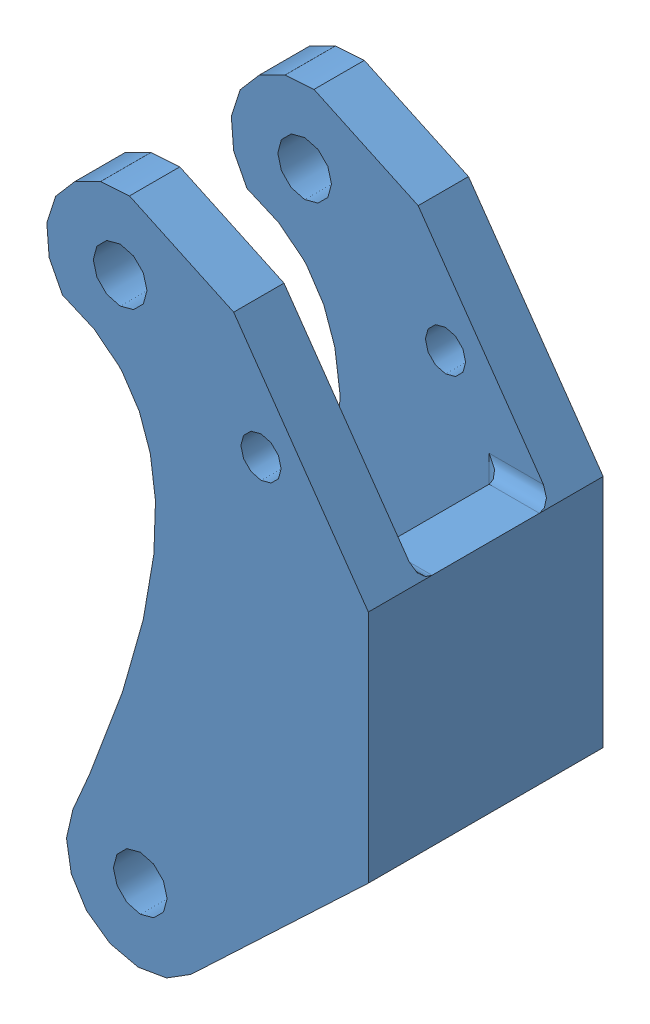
SolidWorks assembly Assemblage chape.SLDASM, configuration Défaut (file format 4400). Lengths in mm.
Overall size (48 99 37).
3 component instances, 3 part files, 4 mates.
Components (placement in the parent):
- chape-1: chape.SLDPRT [Défaut] at (8.5776 91.6585 -20.1462) size (48 99 35)
- vis sans tête à six pans creux à bout tronconique ISO - M6 x 6 - N-1: vis sans tête à six pans creux à bout tronconique ISO - M6 x 6 - N.SLDPRT [ISO 4027 - M5 x 6-N] at (-20.2706 69.2079 -16.3962) x (-0.686904 0.726748 0) z (-0.046495 -0.043946 0.997951) size (6 5 5)
- axe support-1: axe support.SLDPRT [Défaut] at (-25.4224 74.6585 15.8538) x (0.686904 -0.726748 0) z (0.726748 0.686904 0) size (8 37 8)
Mates (geometry in assembly coordinates):
- Coaxiale1: concentric anti-aligned: cylinder of chape-1 through (-25.4224 74.6585 14.8538) axis (0 0 -1) radius 4; cylinder of axe support-1 through (-25.4224 74.6585 -21.1462) axis (0 0 1) radius 4
- Distance1: distance = 1 mm aligned: plane of axe support-1 through (-25.4224 74.6585 -21.1462) normal (0 0 -1); plane of chape-1 through (-25.4224 74.6585 -20.1462) normal (0 0 -1)
- Parallèle2: parallel anti-aligned: cone of axe support-1 through (-21.7803 70.8052 -16.3962) axis (-0.686904 0.726748 0); cylinder of chape-1 through (-75.9592 128.1268 -16.3962) axis (0.686904 -0.726748 0) radius 2.5
- Coïncidente3: coincident aligned: cone of vis sans tête à six pans creux à bout tronconique ISO - M6 x 6 - N-1 through (-22.6747 71.7515 -16.3962) axis (-0.686904 0.726748 0); cone of axe support-1 through (-21.7803 70.8052 -16.3962) axis (-0.686904 0.726748 0)
